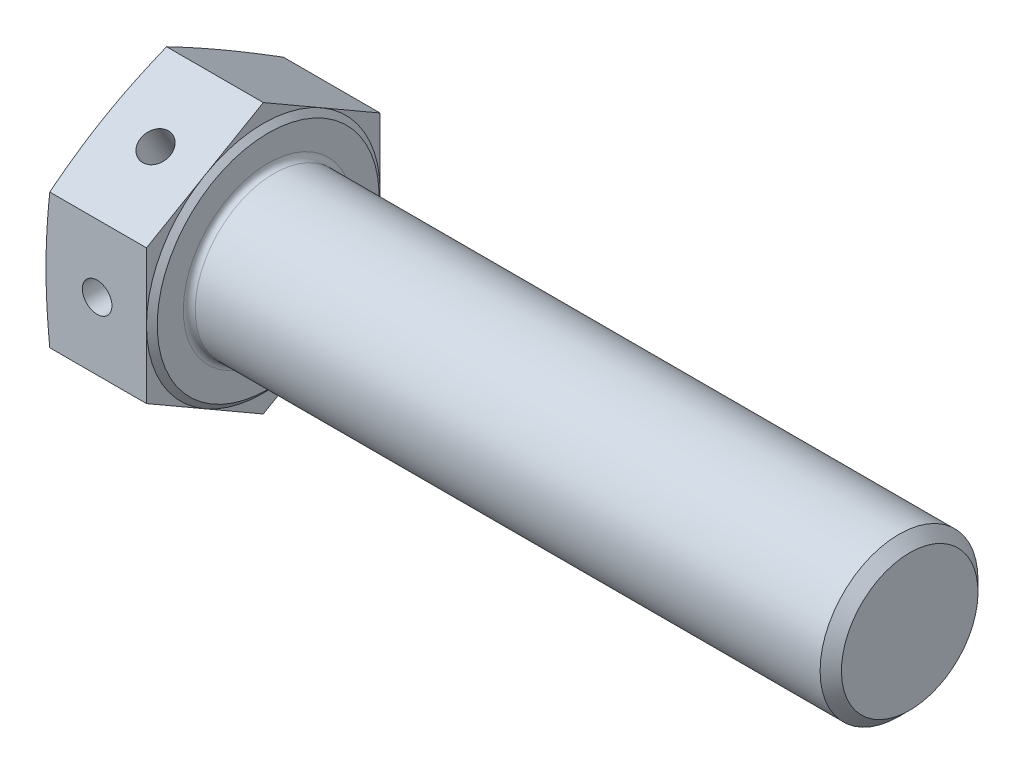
from build123d import *

# Parameters (mm, degrees)
BASEHEAD_DEPTH    = 10.18
SKETCH3_R         = 8
BASEBODY_DEPTH    = 65
CHAMFER1_SIZE     = 1.0825
HEADFILLET_R      = 0.6
SKETCH5_R         = 1.5
HOLE_DEPTH        = 78.809292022
CIRPATTERN1_COUNT = 2
CIRPATTERN1_ANGLE = 60


with BuildPart() as part:
    # Sketch-BaseHead → BaseHead (new body)
    with BuildSketch(Plane(origin=(0, 0, 0), x_dir=(0, 0, -1), z_dir=(1, 0, 0))):
        Polygon((0, -13.665880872), (11.835, -6.832940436), (11.835, 6.832940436), (0, 13.665880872), (-11.835, 6.832940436), (-11.835, -6.832940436), align=None)
    extrude(amount=BASEHEAD_DEPTH)

    # Sketch4 → HeadChamfer (revolve, cut)
    with BuildSketch(Plane(origin=(-0.264637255, -5.916896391, 0), x_dir=(0, 1, 0), z_dir=(0, 0, 1))):
        Polygon((19.582777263, -0.264637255), (17.751896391, -0.264637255), (19.582777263, -0.64829558), align=None)
    revolve(axis=Axis((-4.001564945, 0, 0), (1, 0, 0)), mode=Mode.SUBTRACT)

    # Sketch2 → Revolve1 (revolve)
    with BuildSketch(Plane(origin=(0, 0, 0), x_dir=(1, 0, 0), z_dir=(0, 1, 0)), mode=Mode.PRIVATE) as revolve1_sk:
        Polygon((10.18, 0), (10.68, 0), (10.68, 11.245), (10.18, 11.835), align=None)
    revolve(revolve1_sk.sketch.rotate(Axis((-4.001564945, 0, 0), (1, 0, 0)), 270), axis=Axis((-4.001564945, 0, 0), (1, 0, 0)))

    # Sketch3 → BaseBody (add)
    with BuildSketch(Plane(origin=(10.68, 0, 0), x_dir=(0, 0, -1), z_dir=(1, 0, 0))):
        with Locations(Location((0, 0, 0), (0, 0, 270))):
            Circle(SKETCH3_R)
    extrude(amount=BASEBODY_DEPTH)

    # Chamfer1
    chamfer1_edges = [part.edges().sort_by_distance(p)[0] for p in [
        (75.68, 8, 0),
    ]]
    chamfer(chamfer1_edges, length=CHAMFER1_SIZE)

    # HeadFillet
    headfillet_edges = [part.edges().sort_by_distance(p)[0] for p in [
        (10.68, 8, 0),
    ]]
    fillet(headfillet_edges, radius=HEADFILLET_R)

    # Sketch5 → Hole (cut, symmetric)
    with BuildSketch(Plane.XY):
        with Locations((5.18, 0)):
            Circle(SKETCH5_R)
    hole = extrude(amount=HOLE_DEPTH, both=True, mode=Mode.SUBTRACT)

    # CirPattern1: Hole ×2 about axis
    cirpattern1_axis = Axis((75.68, 0, 0), (-1, 0, 0))
    for i in range(1, CIRPATTERN1_COUNT):
        add(hole.rotate(cirpattern1_axis, i * CIRPATTERN1_ANGLE / (CIRPATTERN1_COUNT - 1)), mode=Mode.SUBTRACT)


solid = part.part
